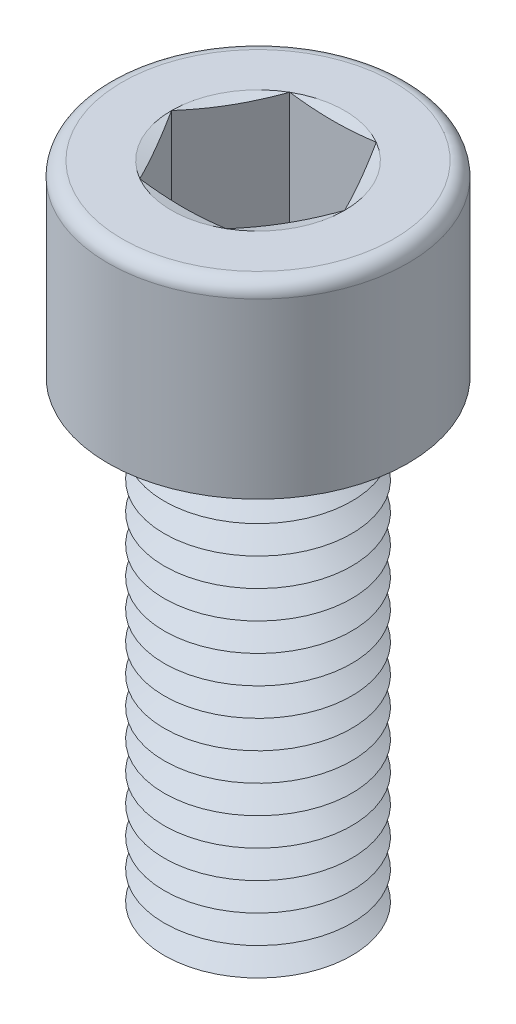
ISO-10303-21;
HEADER;
FILE_DESCRIPTION(('STEP AP214'),'2;1');
FILE_NAME('part.step','',(''),(''),'','','');
FILE_SCHEMA(('AUTOMOTIVE_DESIGN { 1 0 10303 214 1 1 1 1 }'));
ENDSEC;
DATA;
#1=APPLICATION_CONTEXT('core data for automotive mechanical design processes');
#2=APPLICATION_PROTOCOL_DEFINITION('international standard','automotive_design',2000,#1);
#3=PRODUCT_CONTEXT('',#1,'mechanical');
#4=PRODUCT('Part','Part','',(#3));
#5=PRODUCT_RELATED_PRODUCT_CATEGORY('part','',(#4));
#6=PRODUCT_DEFINITION_FORMATION('','',#4);
#7=PRODUCT_DEFINITION_CONTEXT('part definition',#1,'design');
#8=PRODUCT_DEFINITION('design','',#6,#7);
#9=PRODUCT_DEFINITION_SHAPE('','',#8);
#10=(LENGTH_UNIT() NAMED_UNIT(*) SI_UNIT(.MILLI.,.METRE.));
#11=(NAMED_UNIT(*) PLANE_ANGLE_UNIT() SI_UNIT($,.RADIAN.));
#12=(NAMED_UNIT(*) SI_UNIT($,.STERADIAN.) SOLID_ANGLE_UNIT());
#13=UNCERTAINTY_MEASURE_WITH_UNIT(LENGTH_MEASURE(1.E-05),#10,'distance_accuracy_value','');
#14=(GEOMETRIC_REPRESENTATION_CONTEXT(3) GLOBAL_UNCERTAINTY_ASSIGNED_CONTEXT((#13)) GLOBAL_UNIT_ASSIGNED_CONTEXT((#10,
#11,#12)) REPRESENTATION_CONTEXT('',''));
#15=CARTESIAN_POINT('',(0.,0.,0.));
#16=DIRECTION('',(0.,0.,1.));
#17=DIRECTION('',(1.,0.,0.));
#18=AXIS2_PLACEMENT_3D('',#15,#16,#17);
#19=CARTESIAN_POINT('',(0.,6.,0.));
#20=DIRECTION('',(0.,1.,0.));
#21=DIRECTION('',(0.,0.,1.));
#22=AXIS2_PLACEMENT_3D('',#19,#20,#21);
#23=CONICAL_SURFACE('',#22,3.70096189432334,1.0471975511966);
#24=CARTESIAN_POINT('',(0.,6.75,0.));
#25=DIRECTION('',(0.,1.,0.));
#26=DIRECTION('',(0.,0.,1.));
#27=AXIS2_PLACEMENT_3D('',#24,#25,#26);
#28=CIRCLE('',#27,5.);
#29=CARTESIAN_POINT('',(0.,6.75,5.));
#30=VERTEX_POINT('',#29);
#31=EDGE_CURVE('E446',#30,#30,#28,.T.);
#32=ORIENTED_EDGE('',*,*,#31,.F.);
#33=EDGE_LOOP('',(#32));
#34=FACE_BOUND('',#33,.T.);
#35=CARTESIAN_POINT('',(0.,6.,0.));
#36=DIRECTION('',(0.,1.,0.));
#37=DIRECTION('',(0.,0.,1.));
#38=AXIS2_PLACEMENT_3D('',#35,#36,#37);
#39=CIRCLE('',#38,3.70096189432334);
#40=CARTESIAN_POINT('',(0.,6.,3.70096189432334));
#41=VERTEX_POINT('',#40);
#42=EDGE_CURVE('E450',#41,#41,#39,.T.);
#43=ORIENTED_EDGE('',*,*,#42,.T.);
#44=EDGE_LOOP('',(#43));
#45=FACE_BOUND('',#44,.T.);
#46=ADVANCED_FACE('F41',(#34,#45),#23,.T.);
#47=CARTESIAN_POINT('',(0.,5.25,0.));
#48=DIRECTION('',(0.,-1.,0.));
#49=DIRECTION('',(0.,0.,-1.));
#50=AXIS2_PLACEMENT_3D('',#47,#48,#49);
#51=CONICAL_SURFACE('',#50,5.,1.0471975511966);
#52=ORIENTED_EDGE('',*,*,#42,.F.);
#53=EDGE_LOOP('',(#52));
#54=FACE_BOUND('',#53,.T.);
#55=CARTESIAN_POINT('',(0.,5.25,0.));
#56=DIRECTION('',(0.,1.,0.));
#57=DIRECTION('',(0.,0.,1.));
#58=AXIS2_PLACEMENT_3D('',#55,#56,#57);
#59=CIRCLE('',#58,5.);
#60=CARTESIAN_POINT('',(0.,5.25,5.));
#61=VERTEX_POINT('',#60);
#62=EDGE_CURVE('E454',#61,#61,#59,.T.);
#63=ORIENTED_EDGE('',*,*,#62,.T.);
#64=EDGE_LOOP('',(#63));
#65=FACE_BOUND('',#64,.T.);
#66=ADVANCED_FACE('F251',(#54,#65),#51,.T.);
#67=CARTESIAN_POINT('',(0.,0.,0.));
#68=DIRECTION('',(0.,1.,0.));
#69=DIRECTION('',(0.,0.,1.));
#70=AXIS2_PLACEMENT_3D('',#67,#68,#69);
#71=PLANE('',#70);
#72=CARTESIAN_POINT('',(0.,0.,0.));
#73=DIRECTION('',(0.,1.,0.));
#74=DIRECTION('',(0.,0.,1.));
#75=AXIS2_PLACEMENT_3D('',#72,#73,#74);
#76=CIRCLE('',#75,3.70096189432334);
#77=CARTESIAN_POINT('',(0.,0.,3.70096189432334));
#78=VERTEX_POINT('',#77);
#79=EDGE_CURVE('E481',#78,#78,#76,.T.);
#80=ORIENTED_EDGE('',*,*,#79,.F.);
#81=EDGE_LOOP('',(#80));
#82=FACE_BOUND('',#81,.T.);
#83=ADVANCED_FACE('F248',(#82),#71,.F.);
#84=CARTESIAN_POINT('',(0.,0.,0.));
#85=DIRECTION('',(0.,1.,0.));
#86=DIRECTION('',(0.,0.,1.));
#87=AXIS2_PLACEMENT_3D('',#84,#85,#86);
#88=CONICAL_SURFACE('',#87,3.70096189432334,1.0471975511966);
#89=CARTESIAN_POINT('',(0.,0.749999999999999,0.));
#90=DIRECTION('',(0.,1.,0.));
#91=DIRECTION('',(0.,0.,1.));
#92=AXIS2_PLACEMENT_3D('',#89,#90,#91);
#93=CIRCLE('',#92,5.);
#94=CARTESIAN_POINT('',(0.,0.749999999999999,5.));
#95=VERTEX_POINT('',#94);
#96=EDGE_CURVE('E477',#95,#95,#93,.T.);
#97=ORIENTED_EDGE('',*,*,#96,.F.);
#98=EDGE_LOOP('',(#97));
#99=FACE_BOUND('',#98,.T.);
#100=ORIENTED_EDGE('',*,*,#79,.T.);
#101=EDGE_LOOP('',(#100));
#102=FACE_BOUND('',#101,.T.);
#103=ADVANCED_FACE('F250',(#99,#102),#88,.T.);
#104=CARTESIAN_POINT('',(0.,0.749999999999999,0.));
#105=DIRECTION('',(0.,-1.,0.));
#106=DIRECTION('',(0.,0.,-1.));
#107=AXIS2_PLACEMENT_3D('',#104,#105,#106);
#108=CONICAL_SURFACE('',#107,5.,1.0471975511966);
#109=CARTESIAN_POINT('',(0.,1.5,0.));
#110=DIRECTION('',(0.,1.,0.));
#111=DIRECTION('',(0.,0.,1.));
#112=AXIS2_PLACEMENT_3D('',#109,#110,#111);
#113=CIRCLE('',#112,3.70096189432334);
#114=CARTESIAN_POINT('',(0.,1.5,3.70096189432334));
#115=VERTEX_POINT('',#114);
#116=EDGE_CURVE('E473',#115,#115,#113,.T.);
#117=ORIENTED_EDGE('',*,*,#116,.F.);
#118=EDGE_LOOP('',(#117));
#119=FACE_BOUND('',#118,.T.);
#120=ORIENTED_EDGE('',*,*,#96,.T.);
#121=EDGE_LOOP('',(#120));
#122=FACE_BOUND('',#121,.T.);
#123=ADVANCED_FACE('F291',(#119,#122),#108,.T.);
#124=CARTESIAN_POINT('',(0.,1.5,0.));
#125=DIRECTION('',(0.,1.,0.));
#126=DIRECTION('',(0.,0.,1.));
#127=AXIS2_PLACEMENT_3D('',#124,#125,#126);
#128=CONICAL_SURFACE('',#127,3.70096189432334,1.0471975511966);
#129=CARTESIAN_POINT('',(0.,2.25,0.));
#130=DIRECTION('',(0.,1.,0.));
#131=DIRECTION('',(0.,0.,1.));
#132=AXIS2_PLACEMENT_3D('',#129,#130,#131);
#133=CIRCLE('',#132,5.);
#134=CARTESIAN_POINT('',(0.,2.25,5.));
#135=VERTEX_POINT('',#134);
#136=EDGE_CURVE('E469',#135,#135,#133,.T.);
#137=ORIENTED_EDGE('',*,*,#136,.F.);
#138=EDGE_LOOP('',(#137));
#139=FACE_BOUND('',#138,.T.);
#140=ORIENTED_EDGE('',*,*,#116,.T.);
#141=EDGE_LOOP('',(#140));
#142=FACE_BOUND('',#141,.T.);
#143=ADVANCED_FACE('F286',(#139,#142),#128,.T.);
#144=CARTESIAN_POINT('',(0.,2.25,0.));
#145=DIRECTION('',(0.,-1.,0.));
#146=DIRECTION('',(0.,0.,-1.));
#147=AXIS2_PLACEMENT_3D('',#144,#145,#146);
#148=CONICAL_SURFACE('',#147,5.,1.0471975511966);
#149=CARTESIAN_POINT('',(0.,3.,0.));
#150=DIRECTION('',(0.,1.,0.));
#151=DIRECTION('',(0.,0.,1.));
#152=AXIS2_PLACEMENT_3D('',#149,#150,#151);
#153=CIRCLE('',#152,3.70096189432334);
#154=CARTESIAN_POINT('',(0.,3.,3.70096189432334));
#155=VERTEX_POINT('',#154);
#156=EDGE_CURVE('E465',#155,#155,#153,.T.);
#157=ORIENTED_EDGE('',*,*,#156,.F.);
#158=EDGE_LOOP('',(#157));
#159=FACE_BOUND('',#158,.T.);
#160=ORIENTED_EDGE('',*,*,#136,.T.);
#161=EDGE_LOOP('',(#160));
#162=FACE_BOUND('',#161,.T.);
#163=ADVANCED_FACE('F283',(#159,#162),#148,.T.);
#164=CARTESIAN_POINT('',(0.,3.,0.));
#165=DIRECTION('',(0.,1.,0.));
#166=DIRECTION('',(0.,0.,1.));
#167=AXIS2_PLACEMENT_3D('',#164,#165,#166);
#168=CONICAL_SURFACE('',#167,3.70096189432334,1.0471975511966);
#169=CARTESIAN_POINT('',(0.,3.75,0.));
#170=DIRECTION('',(0.,1.,0.));
#171=DIRECTION('',(0.,0.,1.));
#172=AXIS2_PLACEMENT_3D('',#169,#170,#171);
#173=CIRCLE('',#172,5.);
#174=CARTESIAN_POINT('',(0.,3.75,5.));
#175=VERTEX_POINT('',#174);
#176=EDGE_CURVE('E461',#175,#175,#173,.T.);
#177=ORIENTED_EDGE('',*,*,#176,.F.);
#178=EDGE_LOOP('',(#177));
#179=FACE_BOUND('',#178,.T.);
#180=ORIENTED_EDGE('',*,*,#156,.T.);
#181=EDGE_LOOP('',(#180));
#182=FACE_BOUND('',#181,.T.);
#183=ADVANCED_FACE('F277',(#179,#182),#168,.T.);
#184=CARTESIAN_POINT('',(0.,3.75,0.));
#185=DIRECTION('',(0.,-1.,0.));
#186=DIRECTION('',(0.,0.,-1.));
#187=AXIS2_PLACEMENT_3D('',#184,#185,#186);
#188=CONICAL_SURFACE('',#187,5.,1.0471975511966);
#189=CARTESIAN_POINT('',(0.,4.5,0.));
#190=DIRECTION('',(0.,1.,0.));
#191=DIRECTION('',(0.,0.,1.));
#192=AXIS2_PLACEMENT_3D('',#189,#190,#191);
#193=CIRCLE('',#192,3.70096189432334);
#194=CARTESIAN_POINT('',(0.,4.5,3.70096189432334));
#195=VERTEX_POINT('',#194);
#196=EDGE_CURVE('E458',#195,#195,#193,.T.);
#197=ORIENTED_EDGE('',*,*,#196,.F.);
#198=EDGE_LOOP('',(#197));
#199=FACE_BOUND('',#198,.T.);
#200=ORIENTED_EDGE('',*,*,#176,.T.);
#201=EDGE_LOOP('',(#200));
#202=FACE_BOUND('',#201,.T.);
#203=ADVANCED_FACE('F273',(#199,#202),#188,.T.);
#204=CARTESIAN_POINT('',(0.,4.5,0.));
#205=DIRECTION('',(0.,1.,0.));
#206=DIRECTION('',(0.,0.,1.));
#207=AXIS2_PLACEMENT_3D('',#204,#205,#206);
#208=CONICAL_SURFACE('',#207,3.70096189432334,1.0471975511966);
#209=ORIENTED_EDGE('',*,*,#62,.F.);
#210=EDGE_LOOP('',(#209));
#211=FACE_BOUND('',#210,.T.);
#212=ORIENTED_EDGE('',*,*,#196,.T.);
#213=EDGE_LOOP('',(#212));
#214=FACE_BOUND('',#213,.T.);
#215=ADVANCED_FACE('F276',(#211,#214),#208,.T.);
#216=CARTESIAN_POINT('',(0.,7.5,0.));
#217=DIRECTION('',(0.,1.,0.));
#218=DIRECTION('',(0.,0.,1.));
#219=AXIS2_PLACEMENT_3D('',#216,#217,#218);
#220=CONICAL_SURFACE('',#219,3.70096189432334,1.0471975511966);
#221=CARTESIAN_POINT('',(0.,8.25,0.));
#222=DIRECTION('',(0.,1.,0.));
#223=DIRECTION('',(0.,0.,1.));
#224=AXIS2_PLACEMENT_3D('',#221,#222,#223);
#225=CIRCLE('',#224,5.);
#226=CARTESIAN_POINT('',(0.,8.25,5.));
#227=VERTEX_POINT('',#226);
#228=EDGE_CURVE('E438',#227,#227,#225,.T.);
#229=ORIENTED_EDGE('',*,*,#228,.F.);
#230=EDGE_LOOP('',(#229));
#231=FACE_BOUND('',#230,.T.);
#232=CARTESIAN_POINT('',(0.,7.5,0.));
#233=DIRECTION('',(0.,1.,0.));
#234=DIRECTION('',(0.,0.,1.));
#235=AXIS2_PLACEMENT_3D('',#232,#233,#234);
#236=CIRCLE('',#235,3.70096189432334);
#237=CARTESIAN_POINT('',(0.,7.5,3.70096189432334));
#238=VERTEX_POINT('',#237);
#239=EDGE_CURVE('E442',#238,#238,#236,.T.);
#240=ORIENTED_EDGE('',*,*,#239,.T.);
#241=EDGE_LOOP('',(#240));
#242=FACE_BOUND('',#241,.T.);
#243=ADVANCED_FACE('F281',(#231,#242),#220,.T.);
#244=CARTESIAN_POINT('',(0.,6.75,0.));
#245=DIRECTION('',(0.,-1.,0.));
#246=DIRECTION('',(0.,0.,-1.));
#247=AXIS2_PLACEMENT_3D('',#244,#245,#246);
#248=CONICAL_SURFACE('',#247,5.,1.0471975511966);
#249=ORIENTED_EDGE('',*,*,#239,.F.);
#250=EDGE_LOOP('',(#249));
#251=FACE_BOUND('',#250,.T.);
#252=ORIENTED_EDGE('',*,*,#31,.T.);
#253=EDGE_LOOP('',(#252));
#254=FACE_BOUND('',#253,.T.);
#255=ADVANCED_FACE('F730',(#251,#254),#248,.T.);
#256=CARTESIAN_POINT('',(0.,9.,0.));
#257=DIRECTION('',(0.,1.,0.));
#258=DIRECTION('',(0.,0.,1.));
#259=AXIS2_PLACEMENT_3D('',#256,#257,#258);
#260=CONICAL_SURFACE('',#259,3.70096189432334,1.0471975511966);
#261=CARTESIAN_POINT('',(0.,9.75,0.));
#262=DIRECTION('',(0.,1.,0.));
#263=DIRECTION('',(0.,0.,1.));
#264=AXIS2_PLACEMENT_3D('',#261,#262,#263);
#265=CIRCLE('',#264,5.);
#266=CARTESIAN_POINT('',(0.,9.75,5.));
#267=VERTEX_POINT('',#266);
#268=EDGE_CURVE('E430',#267,#267,#265,.T.);
#269=ORIENTED_EDGE('',*,*,#268,.F.);
#270=EDGE_LOOP('',(#269));
#271=FACE_BOUND('',#270,.T.);
#272=CARTESIAN_POINT('',(0.,9.,0.));
#273=DIRECTION('',(0.,1.,0.));
#274=DIRECTION('',(0.,0.,1.));
#275=AXIS2_PLACEMENT_3D('',#272,#273,#274);
#276=CIRCLE('',#275,3.70096189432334);
#277=CARTESIAN_POINT('',(0.,9.,3.70096189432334));
#278=VERTEX_POINT('',#277);
#279=EDGE_CURVE('E434',#278,#278,#276,.T.);
#280=ORIENTED_EDGE('',*,*,#279,.T.);
#281=EDGE_LOOP('',(#280));
#282=FACE_BOUND('',#281,.T.);
#283=ADVANCED_FACE('F739',(#271,#282),#260,.T.);
#284=CARTESIAN_POINT('',(0.,8.25,0.));
#285=DIRECTION('',(0.,-1.,0.));
#286=DIRECTION('',(0.,0.,-1.));
#287=AXIS2_PLACEMENT_3D('',#284,#285,#286);
#288=CONICAL_SURFACE('',#287,5.,1.0471975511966);
#289=ORIENTED_EDGE('',*,*,#279,.F.);
#290=EDGE_LOOP('',(#289));
#291=FACE_BOUND('',#290,.T.);
#292=ORIENTED_EDGE('',*,*,#228,.T.);
#293=EDGE_LOOP('',(#292));
#294=FACE_BOUND('',#293,.T.);
#295=ADVANCED_FACE('F749',(#291,#294),#288,.T.);
#296=CARTESIAN_POINT('',(0.,10.5,0.));
#297=DIRECTION('',(0.,1.,0.));
#298=DIRECTION('',(0.,0.,1.));
#299=AXIS2_PLACEMENT_3D('',#296,#297,#298);
#300=CONICAL_SURFACE('',#299,3.70096189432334,1.0471975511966);
#301=CARTESIAN_POINT('',(0.,11.25,0.));
#302=DIRECTION('',(0.,1.,0.));
#303=DIRECTION('',(0.,0.,1.));
#304=AXIS2_PLACEMENT_3D('',#301,#302,#303);
#305=CIRCLE('',#304,5.);
#306=CARTESIAN_POINT('',(0.,11.25,5.));
#307=VERTEX_POINT('',#306);
#308=EDGE_CURVE('E422',#307,#307,#305,.T.);
#309=ORIENTED_EDGE('',*,*,#308,.F.);
#310=EDGE_LOOP('',(#309));
#311=FACE_BOUND('',#310,.T.);
#312=CARTESIAN_POINT('',(0.,10.5,0.));
#313=DIRECTION('',(0.,1.,0.));
#314=DIRECTION('',(0.,0.,1.));
#315=AXIS2_PLACEMENT_3D('',#312,#313,#314);
#316=CIRCLE('',#315,3.70096189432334);
#317=CARTESIAN_POINT('',(0.,10.5,3.70096189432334));
#318=VERTEX_POINT('',#317);
#319=EDGE_CURVE('E426',#318,#318,#316,.T.);
#320=ORIENTED_EDGE('',*,*,#319,.T.);
#321=EDGE_LOOP('',(#320));
#322=FACE_BOUND('',#321,.T.);
#323=ADVANCED_FACE('F759',(#311,#322),#300,.T.);
#324=CARTESIAN_POINT('',(0.,9.75,0.));
#325=DIRECTION('',(0.,-1.,0.));
#326=DIRECTION('',(0.,0.,-1.));
#327=AXIS2_PLACEMENT_3D('',#324,#325,#326);
#328=CONICAL_SURFACE('',#327,5.,1.0471975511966);
#329=ORIENTED_EDGE('',*,*,#319,.F.);
#330=EDGE_LOOP('',(#329));
#331=FACE_BOUND('',#330,.T.);
#332=ORIENTED_EDGE('',*,*,#268,.T.);
#333=EDGE_LOOP('',(#332));
#334=FACE_BOUND('',#333,.T.);
#335=ADVANCED_FACE('F769',(#331,#334),#328,.T.);
#336=CARTESIAN_POINT('',(0.,12.,0.));
#337=DIRECTION('',(0.,1.,0.));
#338=DIRECTION('',(0.,0.,1.));
#339=AXIS2_PLACEMENT_3D('',#336,#337,#338);
#340=CONICAL_SURFACE('',#339,3.70096189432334,1.0471975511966);
#341=CARTESIAN_POINT('',(0.,12.75,0.));
#342=DIRECTION('',(0.,1.,0.));
#343=DIRECTION('',(0.,0.,1.));
#344=AXIS2_PLACEMENT_3D('',#341,#342,#343);
#345=CIRCLE('',#344,5.);
#346=CARTESIAN_POINT('',(0.,12.75,5.));
#347=VERTEX_POINT('',#346);
#348=EDGE_CURVE('E414',#347,#347,#345,.T.);
#349=ORIENTED_EDGE('',*,*,#348,.F.);
#350=EDGE_LOOP('',(#349));
#351=FACE_BOUND('',#350,.T.);
#352=CARTESIAN_POINT('',(0.,12.,0.));
#353=DIRECTION('',(0.,1.,0.));
#354=DIRECTION('',(0.,0.,1.));
#355=AXIS2_PLACEMENT_3D('',#352,#353,#354);
#356=CIRCLE('',#355,3.70096189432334);
#357=CARTESIAN_POINT('',(0.,12.,3.70096189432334));
#358=VERTEX_POINT('',#357);
#359=EDGE_CURVE('E418',#358,#358,#356,.T.);
#360=ORIENTED_EDGE('',*,*,#359,.T.);
#361=EDGE_LOOP('',(#360));
#362=FACE_BOUND('',#361,.T.);
#363=ADVANCED_FACE('F779',(#351,#362),#340,.T.);
#364=CARTESIAN_POINT('',(0.,11.25,0.));
#365=DIRECTION('',(0.,-1.,0.));
#366=DIRECTION('',(0.,0.,-1.));
#367=AXIS2_PLACEMENT_3D('',#364,#365,#366);
#368=CONICAL_SURFACE('',#367,5.,1.0471975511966);
#369=ORIENTED_EDGE('',*,*,#359,.F.);
#370=EDGE_LOOP('',(#369));
#371=FACE_BOUND('',#370,.T.);
#372=ORIENTED_EDGE('',*,*,#308,.T.);
#373=EDGE_LOOP('',(#372));
#374=FACE_BOUND('',#373,.T.);
#375=ADVANCED_FACE('F789',(#371,#374),#368,.T.);
#376=CARTESIAN_POINT('',(0.,13.5,0.));
#377=DIRECTION('',(0.,1.,0.));
#378=DIRECTION('',(0.,0.,1.));
#379=AXIS2_PLACEMENT_3D('',#376,#377,#378);
#380=CONICAL_SURFACE('',#379,3.70096189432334,1.0471975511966);
#381=CARTESIAN_POINT('',(0.,14.25,0.));
#382=DIRECTION('',(0.,1.,0.));
#383=DIRECTION('',(0.,0.,1.));
#384=AXIS2_PLACEMENT_3D('',#381,#382,#383);
#385=CIRCLE('',#384,5.);
#386=CARTESIAN_POINT('',(0.,14.25,5.));
#387=VERTEX_POINT('',#386);
#388=EDGE_CURVE('E406',#387,#387,#385,.T.);
#389=ORIENTED_EDGE('',*,*,#388,.F.);
#390=EDGE_LOOP('',(#389));
#391=FACE_BOUND('',#390,.T.);
#392=CARTESIAN_POINT('',(0.,13.5,0.));
#393=DIRECTION('',(0.,1.,0.));
#394=DIRECTION('',(0.,0.,1.));
#395=AXIS2_PLACEMENT_3D('',#392,#393,#394);
#396=CIRCLE('',#395,3.70096189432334);
#397=CARTESIAN_POINT('',(0.,13.5,3.70096189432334));
#398=VERTEX_POINT('',#397);
#399=EDGE_CURVE('E410',#398,#398,#396,.T.);
#400=ORIENTED_EDGE('',*,*,#399,.T.);
#401=EDGE_LOOP('',(#400));
#402=FACE_BOUND('',#401,.T.);
#403=ADVANCED_FACE('F799',(#391,#402),#380,.T.);
#404=CARTESIAN_POINT('',(0.,12.75,0.));
#405=DIRECTION('',(0.,-1.,0.));
#406=DIRECTION('',(0.,0.,-1.));
#407=AXIS2_PLACEMENT_3D('',#404,#405,#406);
#408=CONICAL_SURFACE('',#407,5.,1.0471975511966);
#409=ORIENTED_EDGE('',*,*,#399,.F.);
#410=EDGE_LOOP('',(#409));
#411=FACE_BOUND('',#410,.T.);
#412=ORIENTED_EDGE('',*,*,#348,.T.);
#413=EDGE_LOOP('',(#412));
#414=FACE_BOUND('',#413,.T.);
#415=ADVANCED_FACE('F809',(#411,#414),#408,.T.);
#416=CARTESIAN_POINT('',(0.,15.,0.));
#417=DIRECTION('',(0.,1.,0.));
#418=DIRECTION('',(0.,0.,1.));
#419=AXIS2_PLACEMENT_3D('',#416,#417,#418);
#420=CONICAL_SURFACE('',#419,3.70096189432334,1.0471975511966);
#421=CARTESIAN_POINT('',(0.,15.75,0.));
#422=DIRECTION('',(0.,1.,0.));
#423=DIRECTION('',(0.,0.,1.));
#424=AXIS2_PLACEMENT_3D('',#421,#422,#423);
#425=CIRCLE('',#424,5.);
#426=CARTESIAN_POINT('',(0.,15.75,5.));
#427=VERTEX_POINT('',#426);
#428=EDGE_CURVE('E398',#427,#427,#425,.T.);
#429=ORIENTED_EDGE('',*,*,#428,.F.);
#430=EDGE_LOOP('',(#429));
#431=FACE_BOUND('',#430,.T.);
#432=CARTESIAN_POINT('',(0.,15.,0.));
#433=DIRECTION('',(0.,1.,0.));
#434=DIRECTION('',(0.,0.,1.));
#435=AXIS2_PLACEMENT_3D('',#432,#433,#434);
#436=CIRCLE('',#435,3.70096189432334);
#437=CARTESIAN_POINT('',(0.,15.,3.70096189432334));
#438=VERTEX_POINT('',#437);
#439=EDGE_CURVE('E402',#438,#438,#436,.T.);
#440=ORIENTED_EDGE('',*,*,#439,.T.);
#441=EDGE_LOOP('',(#440));
#442=FACE_BOUND('',#441,.T.);
#443=ADVANCED_FACE('F819',(#431,#442),#420,.T.);
#444=CARTESIAN_POINT('',(0.,14.25,0.));
#445=DIRECTION('',(0.,-1.,0.));
#446=DIRECTION('',(0.,0.,-1.));
#447=AXIS2_PLACEMENT_3D('',#444,#445,#446);
#448=CONICAL_SURFACE('',#447,5.,1.0471975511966);
#449=ORIENTED_EDGE('',*,*,#439,.F.);
#450=EDGE_LOOP('',(#449));
#451=FACE_BOUND('',#450,.T.);
#452=ORIENTED_EDGE('',*,*,#388,.T.);
#453=EDGE_LOOP('',(#452));
#454=FACE_BOUND('',#453,.T.);
#455=ADVANCED_FACE('F829',(#451,#454),#448,.T.);
#456=CARTESIAN_POINT('',(0.,16.5,0.));
#457=DIRECTION('',(0.,1.,0.));
#458=DIRECTION('',(0.,0.,1.));
#459=AXIS2_PLACEMENT_3D('',#456,#457,#458);
#460=CONICAL_SURFACE('',#459,3.70096189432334,1.0471975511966);
#461=CARTESIAN_POINT('',(0.,17.25,0.));
#462=DIRECTION('',(0.,1.,0.));
#463=DIRECTION('',(0.,0.,1.));
#464=AXIS2_PLACEMENT_3D('',#461,#462,#463);
#465=CIRCLE('',#464,5.);
#466=CARTESIAN_POINT('',(0.,17.25,5.));
#467=VERTEX_POINT('',#466);
#468=EDGE_CURVE('E390',#467,#467,#465,.T.);
#469=ORIENTED_EDGE('',*,*,#468,.F.);
#470=EDGE_LOOP('',(#469));
#471=FACE_BOUND('',#470,.T.);
#472=CARTESIAN_POINT('',(0.,16.5,0.));
#473=DIRECTION('',(0.,1.,0.));
#474=DIRECTION('',(0.,0.,1.));
#475=AXIS2_PLACEMENT_3D('',#472,#473,#474);
#476=CIRCLE('',#475,3.70096189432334);
#477=CARTESIAN_POINT('',(0.,16.5,3.70096189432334));
#478=VERTEX_POINT('',#477);
#479=EDGE_CURVE('E394',#478,#478,#476,.T.);
#480=ORIENTED_EDGE('',*,*,#479,.T.);
#481=EDGE_LOOP('',(#480));
#482=FACE_BOUND('',#481,.T.);
#483=ADVANCED_FACE('F839',(#471,#482),#460,.T.);
#484=CARTESIAN_POINT('',(0.,15.75,0.));
#485=DIRECTION('',(0.,-1.,0.));
#486=DIRECTION('',(0.,0.,-1.));
#487=AXIS2_PLACEMENT_3D('',#484,#485,#486);
#488=CONICAL_SURFACE('',#487,5.,1.0471975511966);
#489=ORIENTED_EDGE('',*,*,#479,.F.);
#490=EDGE_LOOP('',(#489));
#491=FACE_BOUND('',#490,.T.);
#492=ORIENTED_EDGE('',*,*,#428,.T.);
#493=EDGE_LOOP('',(#492));
#494=FACE_BOUND('',#493,.T.);
#495=ADVANCED_FACE('F849',(#491,#494),#488,.T.);
#496=CARTESIAN_POINT('',(0.,18.,0.));
#497=DIRECTION('',(0.,1.,0.));
#498=DIRECTION('',(0.,0.,1.));
#499=AXIS2_PLACEMENT_3D('',#496,#497,#498);
#500=CONICAL_SURFACE('',#499,3.70096189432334,1.0471975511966);
#501=CARTESIAN_POINT('',(0.,18.75,0.));
#502=DIRECTION('',(0.,1.,0.));
#503=DIRECTION('',(0.,0.,1.));
#504=AXIS2_PLACEMENT_3D('',#501,#502,#503);
#505=CIRCLE('',#504,5.);
#506=CARTESIAN_POINT('',(0.,18.75,5.));
#507=VERTEX_POINT('',#506);
#508=EDGE_CURVE('E382',#507,#507,#505,.T.);
#509=ORIENTED_EDGE('',*,*,#508,.F.);
#510=EDGE_LOOP('',(#509));
#511=FACE_BOUND('',#510,.T.);
#512=CARTESIAN_POINT('',(0.,18.,0.));
#513=DIRECTION('',(0.,1.,0.));
#514=DIRECTION('',(0.,0.,1.));
#515=AXIS2_PLACEMENT_3D('',#512,#513,#514);
#516=CIRCLE('',#515,3.70096189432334);
#517=CARTESIAN_POINT('',(0.,18.,3.70096189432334));
#518=VERTEX_POINT('',#517);
#519=EDGE_CURVE('E386',#518,#518,#516,.T.);
#520=ORIENTED_EDGE('',*,*,#519,.T.);
#521=EDGE_LOOP('',(#520));
#522=FACE_BOUND('',#521,.T.);
#523=ADVANCED_FACE('F859',(#511,#522),#500,.T.);
#524=CARTESIAN_POINT('',(0.,17.25,0.));
#525=DIRECTION('',(0.,-1.,0.));
#526=DIRECTION('',(0.,0.,-1.));
#527=AXIS2_PLACEMENT_3D('',#524,#525,#526);
#528=CONICAL_SURFACE('',#527,5.,1.0471975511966);
#529=ORIENTED_EDGE('',*,*,#519,.F.);
#530=EDGE_LOOP('',(#529));
#531=FACE_BOUND('',#530,.T.);
#532=ORIENTED_EDGE('',*,*,#468,.T.);
#533=EDGE_LOOP('',(#532));
#534=FACE_BOUND('',#533,.T.);
#535=ADVANCED_FACE('F869',(#531,#534),#528,.T.);
#536=CARTESIAN_POINT('',(0.,19.5,0.));
#537=DIRECTION('',(0.,1.,0.));
#538=DIRECTION('',(0.,0.,1.));
#539=AXIS2_PLACEMENT_3D('',#536,#537,#538);
#540=CONICAL_SURFACE('',#539,3.70096189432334,1.0471975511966);
#541=CARTESIAN_POINT('',(0.,20.25,0.));
#542=DIRECTION('',(0.,1.,0.));
#543=DIRECTION('',(0.,0.,1.));
#544=AXIS2_PLACEMENT_3D('',#541,#542,#543);
#545=CIRCLE('',#544,5.);
#546=CARTESIAN_POINT('',(0.,20.25,5.));
#547=VERTEX_POINT('',#546);
#548=EDGE_CURVE('E375',#547,#547,#545,.T.);
#549=ORIENTED_EDGE('',*,*,#548,.F.);
#550=EDGE_LOOP('',(#549));
#551=FACE_BOUND('',#550,.T.);
#552=CARTESIAN_POINT('',(0.,19.5,0.));
#553=DIRECTION('',(0.,1.,0.));
#554=DIRECTION('',(0.,0.,1.));
#555=AXIS2_PLACEMENT_3D('',#552,#553,#554);
#556=CIRCLE('',#555,3.70096189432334);
#557=CARTESIAN_POINT('',(0.,19.5,3.70096189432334));
#558=VERTEX_POINT('',#557);
#559=EDGE_CURVE('E378',#558,#558,#556,.T.);
#560=ORIENTED_EDGE('',*,*,#559,.T.);
#561=EDGE_LOOP('',(#560));
#562=FACE_BOUND('',#561,.T.);
#563=ADVANCED_FACE('F879',(#551,#562),#540,.T.);
#564=CARTESIAN_POINT('',(0.,18.75,0.));
#565=DIRECTION('',(0.,-1.,0.));
#566=DIRECTION('',(0.,0.,-1.));
#567=AXIS2_PLACEMENT_3D('',#564,#565,#566);
#568=CONICAL_SURFACE('',#567,5.,1.0471975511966);
#569=ORIENTED_EDGE('',*,*,#559,.F.);
#570=EDGE_LOOP('',(#569));
#571=FACE_BOUND('',#570,.T.);
#572=ORIENTED_EDGE('',*,*,#508,.T.);
#573=EDGE_LOOP('',(#572));
#574=FACE_BOUND('',#573,.T.);
#575=ADVANCED_FACE('F889',(#571,#574),#568,.T.);
#576=CARTESIAN_POINT('',(0.,21.,0.));
#577=DIRECTION('',(0.,1.,0.));
#578=DIRECTION('',(0.,0.,1.));
#579=AXIS2_PLACEMENT_3D('',#576,#577,#578);
#580=CONICAL_SURFACE('',#579,3.70096189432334,1.0471975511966);
#581=CARTESIAN_POINT('',(0.,21.75,0.));
#582=DIRECTION('',(0.,1.,0.));
#583=DIRECTION('',(0.,0.,1.));
#584=AXIS2_PLACEMENT_3D('',#581,#582,#583);
#585=CIRCLE('',#584,5.);
#586=CARTESIAN_POINT('',(0.,21.75,5.));
#587=VERTEX_POINT('',#586);
#588=EDGE_CURVE('E367',#587,#587,#585,.T.);
#589=ORIENTED_EDGE('',*,*,#588,.F.);
#590=EDGE_LOOP('',(#589));
#591=FACE_BOUND('',#590,.T.);
#592=CARTESIAN_POINT('',(0.,21.,0.));
#593=DIRECTION('',(0.,1.,0.));
#594=DIRECTION('',(0.,0.,1.));
#595=AXIS2_PLACEMENT_3D('',#592,#593,#594);
#596=CIRCLE('',#595,3.70096189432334);
#597=CARTESIAN_POINT('',(0.,21.,3.70096189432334));
#598=VERTEX_POINT('',#597);
#599=EDGE_CURVE('E371',#598,#598,#596,.T.);
#600=ORIENTED_EDGE('',*,*,#599,.T.);
#601=EDGE_LOOP('',(#600));
#602=FACE_BOUND('',#601,.T.);
#603=ADVANCED_FACE('F899',(#591,#602),#580,.T.);
#604=CARTESIAN_POINT('',(0.,20.25,0.));
#605=DIRECTION('',(0.,-1.,0.));
#606=DIRECTION('',(0.,0.,-1.));
#607=AXIS2_PLACEMENT_3D('',#604,#605,#606);
#608=CONICAL_SURFACE('',#607,5.,1.0471975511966);
#609=ORIENTED_EDGE('',*,*,#599,.F.);
#610=EDGE_LOOP('',(#609));
#611=FACE_BOUND('',#610,.T.);
#612=ORIENTED_EDGE('',*,*,#548,.T.);
#613=EDGE_LOOP('',(#612));
#614=FACE_BOUND('',#613,.T.);
#615=ADVANCED_FACE('F909',(#611,#614),#608,.T.);
#616=CARTESIAN_POINT('',(0.,22.5,0.));
#617=DIRECTION('',(0.,1.,0.));
#618=DIRECTION('',(0.,0.,1.));
#619=AXIS2_PLACEMENT_3D('',#616,#617,#618);
#620=CONICAL_SURFACE('',#619,3.70096189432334,1.0471975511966);
#621=CARTESIAN_POINT('',(0.,23.25,0.));
#622=DIRECTION('',(0.,1.,0.));
#623=DIRECTION('',(0.,0.,1.));
#624=AXIS2_PLACEMENT_3D('',#621,#622,#623);
#625=CIRCLE('',#624,5.);
#626=CARTESIAN_POINT('',(0.,23.25,5.));
#627=VERTEX_POINT('',#626);
#628=EDGE_CURVE('E351',#627,#627,#625,.T.);
#629=ORIENTED_EDGE('',*,*,#628,.F.);
#630=EDGE_LOOP('',(#629));
#631=FACE_BOUND('',#630,.T.);
#632=CARTESIAN_POINT('',(0.,22.5,0.));
#633=DIRECTION('',(0.,1.,0.));
#634=DIRECTION('',(0.,0.,1.));
#635=AXIS2_PLACEMENT_3D('',#632,#633,#634);
#636=CIRCLE('',#635,3.70096189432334);
#637=CARTESIAN_POINT('',(0.,22.5,3.70096189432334));
#638=VERTEX_POINT('',#637);
#639=EDGE_CURVE('E363',#638,#638,#636,.T.);
#640=ORIENTED_EDGE('',*,*,#639,.T.);
#641=EDGE_LOOP('',(#640));
#642=FACE_BOUND('',#641,.T.);
#643=ADVANCED_FACE('F919',(#631,#642),#620,.T.);
#644=CARTESIAN_POINT('',(0.,21.75,0.));
#645=DIRECTION('',(0.,-1.,0.));
#646=DIRECTION('',(0.,0.,-1.));
#647=AXIS2_PLACEMENT_3D('',#644,#645,#646);
#648=CONICAL_SURFACE('',#647,5.,1.0471975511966);
#649=ORIENTED_EDGE('',*,*,#639,.F.);
#650=EDGE_LOOP('',(#649));
#651=FACE_BOUND('',#650,.T.);
#652=ORIENTED_EDGE('',*,*,#588,.T.);
#653=EDGE_LOOP('',(#652));
#654=FACE_BOUND('',#653,.T.);
#655=ADVANCED_FACE('F929',(#651,#654),#648,.T.);
#656=CARTESIAN_POINT('',(0.,24.,0.));
#657=DIRECTION('',(0.,1.,0.));
#658=DIRECTION('',(0.,0.,1.));
#659=AXIS2_PLACEMENT_3D('',#656,#657,#658);
#660=CONICAL_SURFACE('',#659,3.70096189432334,1.0471975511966);
#661=CARTESIAN_POINT('',(0.,24.75,0.));
#662=DIRECTION('',(0.,1.,0.));
#663=DIRECTION('',(0.,0.,1.));
#664=AXIS2_PLACEMENT_3D('',#661,#662,#663);
#665=CIRCLE('',#664,5.);
#666=CARTESIAN_POINT('',(0.,24.75,5.));
#667=VERTEX_POINT('',#666);
#668=EDGE_CURVE('E358',#667,#667,#665,.T.);
#669=ORIENTED_EDGE('',*,*,#668,.F.);
#670=EDGE_LOOP('',(#669));
#671=FACE_BOUND('',#670,.T.);
#672=CARTESIAN_POINT('',(0.,24.,0.));
#673=DIRECTION('',(0.,1.,0.));
#674=DIRECTION('',(0.,0.,1.));
#675=AXIS2_PLACEMENT_3D('',#672,#673,#674);
#676=CIRCLE('',#675,3.70096189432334);
#677=CARTESIAN_POINT('',(0.,24.,3.70096189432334));
#678=VERTEX_POINT('',#677);
#679=EDGE_CURVE('E348',#678,#678,#676,.T.);
#680=ORIENTED_EDGE('',*,*,#679,.T.);
#681=EDGE_LOOP('',(#680));
#682=FACE_BOUND('',#681,.T.);
#683=ADVANCED_FACE('F939',(#671,#682),#660,.T.);
#684=CARTESIAN_POINT('',(0.,23.25,0.));
#685=DIRECTION('',(0.,-1.,0.));
#686=DIRECTION('',(0.,0.,-1.));
#687=AXIS2_PLACEMENT_3D('',#684,#685,#686);
#688=CONICAL_SURFACE('',#687,5.,1.0471975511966);
#689=ORIENTED_EDGE('',*,*,#679,.F.);
#690=EDGE_LOOP('',(#689));
#691=FACE_BOUND('',#690,.T.);
#692=ORIENTED_EDGE('',*,*,#628,.T.);
#693=EDGE_LOOP('',(#692));
#694=FACE_BOUND('',#693,.T.);
#695=ADVANCED_FACE('F195',(#691,#694),#688,.T.);
#696=CARTESIAN_POINT('',(0.,35.,0.));
#697=DIRECTION('',(0.,1.,0.));
#698=DIRECTION('',(0.,0.,1.));
#699=AXIS2_PLACEMENT_3D('',#696,#697,#698);
#700=PLANE('',#699);
#701=CARTESIAN_POINT('',(0.,35.,0.));
#702=DIRECTION('',(0.,1.,0.));
#703=DIRECTION('',(0.,0.,1.));
#704=AXIS2_PLACEMENT_3D('',#701,#702,#703);
#705=CIRCLE('',#704,4.61880215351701);
#706=CARTESIAN_POINT('',(2.3094010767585,35.,4.));
#707=VERTEX_POINT('',#706);
#708=CARTESIAN_POINT('',(4.61880215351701,35.,0.));
#709=VERTEX_POINT('',#708);
#710=EDGE_CURVE('E121',#707,#709,#705,.T.);
#711=ORIENTED_EDGE('',*,*,#710,.F.);
#712=CARTESIAN_POINT('',(0.,35.,0.));
#713=DIRECTION('',(0.,1.,0.));
#714=DIRECTION('',(0.,0.,1.));
#715=AXIS2_PLACEMENT_3D('',#712,#713,#714);
#716=CIRCLE('',#715,4.61880215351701);
#717=CARTESIAN_POINT('',(-2.3094010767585,35.,4.));
#718=VERTEX_POINT('',#717);
#719=EDGE_CURVE('E45',#718,#707,#716,.T.);
#720=ORIENTED_EDGE('',*,*,#719,.F.);
#721=CARTESIAN_POINT('',(-4.61880215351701,35.,0.));
#722=VERTEX_POINT('',#721);
#723=EDGE_CURVE('E138',#722,#718,#716,.T.);
#724=ORIENTED_EDGE('',*,*,#723,.F.);
#725=CARTESIAN_POINT('',(-2.3094010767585,35.,-4.));
#726=VERTEX_POINT('',#725);
#727=EDGE_CURVE('E553',#726,#722,#716,.T.);
#728=ORIENTED_EDGE('',*,*,#727,.F.);
#729=CARTESIAN_POINT('',(2.3094010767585,35.,-4.));
#730=VERTEX_POINT('',#729);
#731=EDGE_CURVE('E51',#730,#726,#716,.T.);
#732=ORIENTED_EDGE('',*,*,#731,.F.);
#733=EDGE_CURVE('E11',#709,#730,#716,.T.);
#734=ORIENTED_EDGE('',*,*,#733,.F.);
#735=EDGE_LOOP('',(#711,#720,#724,#728,#732,#734));
#736=FACE_BOUND('',#735,.T.);
#737=CARTESIAN_POINT('',(0.,35.,0.));
#738=DIRECTION('',(0.,1.,0.));
#739=DIRECTION('',(0.,0.,1.));
#740=AXIS2_PLACEMENT_3D('',#737,#738,#739);
#741=CIRCLE('',#740,7.25);
#742=CARTESIAN_POINT('',(0.,35.,7.25));
#743=VERTEX_POINT('',#742);
#744=EDGE_CURVE('E526',#743,#743,#741,.T.);
#745=ORIENTED_EDGE('',*,*,#744,.T.);
#746=EDGE_LOOP('',(#745));
#747=FACE_BOUND('',#746,.T.);
#748=ADVANCED_FACE('F140',(#736,#747),#700,.T.);
#749=CARTESIAN_POINT('',(0.,34.25,0.));
#750=DIRECTION('',(0.,1.,0.));
#751=DIRECTION('',(0.,0.,1.));
#752=AXIS2_PLACEMENT_3D('',#749,#750,#751);
#753=TOROIDAL_SURFACE('',#752,7.25,0.75);
#754=CARTESIAN_POINT('',(0.,34.25,0.));
#755=DIRECTION('',(0.,1.,0.));
#756=DIRECTION('',(0.,0.,1.));
#757=AXIS2_PLACEMENT_3D('',#754,#755,#756);
#758=CIRCLE('',#757,8.);
#759=CARTESIAN_POINT('',(0.,34.25,8.));
#760=VERTEX_POINT('',#759);
#761=EDGE_CURVE('E530',#760,#760,#758,.F.);
#762=ORIENTED_EDGE('',*,*,#761,.F.);
#763=EDGE_LOOP('',(#762));
#764=FACE_BOUND('',#763,.T.);
#765=ORIENTED_EDGE('',*,*,#744,.F.);
#766=EDGE_LOOP('',(#765));
#767=FACE_BOUND('',#766,.T.);
#768=ADVANCED_FACE('F43',(#764,#767),#753,.T.);
#769=CARTESIAN_POINT('',(0.,35.,0.));
#770=DIRECTION('',(0.,-1.,0.));
#771=DIRECTION('',(0.,0.,-1.));
#772=AXIS2_PLACEMENT_3D('',#769,#770,#771);
#773=CYLINDRICAL_SURFACE('',#772,8.);
#774=ORIENTED_EDGE('',*,*,#761,.T.);
#775=EDGE_LOOP('',(#774));
#776=FACE_BOUND('',#775,.T.);
#777=CARTESIAN_POINT('',(0.,25.,0.));
#778=DIRECTION('',(0.,1.,0.));
#779=DIRECTION('',(0.,0.,1.));
#780=AXIS2_PLACEMENT_3D('',#777,#778,#779);
#781=CIRCLE('',#780,8.);
#782=CARTESIAN_POINT('',(0.,25.,8.));
#783=VERTEX_POINT('',#782);
#784=EDGE_CURVE('E513',#783,#783,#781,.T.);
#785=ORIENTED_EDGE('',*,*,#784,.T.);
#786=EDGE_LOOP('',(#785));
#787=FACE_BOUND('',#786,.T.);
#788=ADVANCED_FACE('F243',(#776,#787),#773,.T.);
#789=CARTESIAN_POINT('',(0.,25.,0.));
#790=DIRECTION('',(0.,1.,0.));
#791=DIRECTION('',(0.,0.,1.));
#792=AXIS2_PLACEMENT_3D('',#789,#790,#791);
#793=PLANE('',#792);
#794=ORIENTED_EDGE('',*,*,#784,.F.);
#795=EDGE_LOOP('',(#794));
#796=FACE_BOUND('',#795,.T.);
#797=CARTESIAN_POINT('',(0.,25.,0.));
#798=DIRECTION('',(0.,1.,0.));
#799=DIRECTION('',(0.,0.,1.));
#800=AXIS2_PLACEMENT_3D('',#797,#798,#799);
#801=CIRCLE('',#800,5.);
#802=CARTESIAN_POINT('',(0.,25.,5.));
#803=VERTEX_POINT('',#802);
#804=EDGE_CURVE('E522',#803,#803,#801,.T.);
#805=ORIENTED_EDGE('',*,*,#804,.T.);
#806=EDGE_LOOP('',(#805));
#807=FACE_BOUND('',#806,.T.);
#808=ADVANCED_FACE('F239',(#796,#807),#793,.F.);
#809=CARTESIAN_POINT('',(0.,25.,0.));
#810=DIRECTION('',(0.,-1.,0.));
#811=DIRECTION('',(0.,0.,-1.));
#812=AXIS2_PLACEMENT_3D('',#809,#810,#811);
#813=CYLINDRICAL_SURFACE('',#812,5.);
#814=ORIENTED_EDGE('',*,*,#668,.T.);
#815=EDGE_LOOP('',(#814));
#816=FACE_BOUND('',#815,.T.);
#817=ORIENTED_EDGE('',*,*,#804,.F.);
#818=EDGE_LOOP('',(#817));
#819=FACE_BOUND('',#818,.T.);
#820=ADVANCED_FACE('F242',(#816,#819),#813,.T.);
#821=CARTESIAN_POINT('',(0.,35.,0.));
#822=DIRECTION('',(0.,1.,0.));
#823=DIRECTION('',(0.,0.,1.));
#824=AXIS2_PLACEMENT_3D('',#821,#822,#823);
#825=CONICAL_SURFACE('',#824,4.61880215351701,1.30899693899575);
#826=ORIENTED_EDGE('',*,*,#719,.T.);
#827=CARTESIAN_POINT('',(-6.02881516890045,35.7010337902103,4.));
#828=CARTESIAN_POINT('',(-5.84819587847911,35.6607170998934,4.));
#829=CARTESIAN_POINT('',(-5.6674614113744,35.6209072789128,4.));
#830=CARTESIAN_POINT('',(-5.30570552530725,35.5425748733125,4.));
#831=CARTESIAN_POINT('',(-5.12468409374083,35.5040523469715,4.));
#832=CARTESIAN_POINT('',(-4.76212658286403,35.4285326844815,4.));
#833=CARTESIAN_POINT('',(-4.58059016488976,35.3915371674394,4.));
#834=CARTESIAN_POINT('',(-4.21713405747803,35.3194839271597,4.));
#835=CARTESIAN_POINT('',(-4.03521437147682,35.2844261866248,4.));
#836=CARTESIAN_POINT('',(-3.67250657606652,35.217001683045,4.));
#837=CARTESIAN_POINT('',(-3.4917223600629,35.1846141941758,4.));
#838=CARTESIAN_POINT('',(-3.12965653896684,35.1227577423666,4.));
#839=CARTESIAN_POINT('',(-2.94837492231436,35.093288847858,4.));
#840=CARTESIAN_POINT('',(-2.40374454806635,35.0102645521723,4.));
#841=CARTESIAN_POINT('',(-2.03952090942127,34.9620742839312,4.));
#842=CARTESIAN_POINT('',(-1.48950033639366,34.9051820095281,4.));
#843=CARTESIAN_POINT('',(-1.30450135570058,34.8887355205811,4.));
#844=CARTESIAN_POINT('',(-0.934053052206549,34.861988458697,4.));
#845=CARTESIAN_POINT('',(-0.748603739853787,34.8516877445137,4.));
#846=CARTESIAN_POINT('',(-0.377528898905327,34.8378309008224,4.));
#847=CARTESIAN_POINT('',(-0.191903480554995,34.834271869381,4.));
#848=CARTESIAN_POINT('',(0.179350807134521,34.8341156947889,4.));
#849=CARTESIAN_POINT('',(0.364979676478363,34.8375185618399,4.));
#850=CARTESIAN_POINT('',(0.736742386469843,34.8510980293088,4.));
#851=CARTESIAN_POINT('',(0.922875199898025,34.8613021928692,4.));
#852=CARTESIAN_POINT('',(1.29469888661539,34.8879135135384,4.));
#853=CARTESIAN_POINT('',(1.48038973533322,34.9043210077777,4.));
#854=CARTESIAN_POINT('',(1.85132520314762,34.942529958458,4.));
#855=CARTESIAN_POINT('',(2.03656946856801,34.9643347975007,4.));
#856=CARTESIAN_POINT('',(2.40646407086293,35.0124559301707,4.));
#857=CARTESIAN_POINT('',(2.59111440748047,35.0387722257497,4.));
#858=CARTESIAN_POINT('',(2.9646704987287,35.0958323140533,4.));
#859=CARTESIAN_POINT('',(3.15356118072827,35.1266739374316,4.));
#860=CARTESIAN_POINT('',(3.53080577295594,35.1914895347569,4.));
#861=CARTESIAN_POINT('',(3.71915966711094,35.225463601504,4.));
#862=CARTESIAN_POINT('',(4.28356279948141,35.3311227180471,4.));
#863=CARTESIAN_POINT('',(4.65891157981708,35.4065379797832,4.));
#864=CARTESIAN_POINT('',(5.4083535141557,35.5637698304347,4.));
#865=CARTESIAN_POINT('',(5.7824462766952,35.645588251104,4.));
#866=CARTESIAN_POINT('',(6.52968076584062,35.8134827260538,4.));
#867=CARTESIAN_POINT('',(6.90282246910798,35.8995588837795,4.));
#868=CARTESIAN_POINT('',(7.64386653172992,36.0735615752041,4.));
#869=CARTESIAN_POINT('',(8.0117772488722,36.1614526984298,4.));
#870=CARTESIAN_POINT('',(8.7471149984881,36.3392675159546,4.));
#871=CARTESIAN_POINT('',(9.11454201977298,36.4291912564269,4.));
#872=CARTESIAN_POINT('',(9.84851788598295,36.6103931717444,4.));
#873=CARTESIAN_POINT('',(10.2150672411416,36.7016692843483,4.));
#874=CARTESIAN_POINT('',(10.9478692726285,36.8853497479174,4.));
#875=CARTESIAN_POINT('',(11.3141219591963,36.977754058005,4.));
#876=CARTESIAN_POINT('',(11.6802738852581,37.0705515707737,4.));
#877=B_SPLINE_CURVE_WITH_KNOTS('',3,(#827,#828,#829,#830,#831,#832,#833,#834,#835,#836,#837,
#838,#839,#840,#841,#842,#843,#844,#845,#846,#847,#848,#849,#850,#851,#852,#853,#854,#855,#856,
#857,#858,#859,#860,#861,#862,#863,#864,#865,#866,#867,#868,#869,#870,#871,#872,#873,#874,#875,
#876),.UNSPECIFIED.,.F.,.F.,(4,2,2,2,2,2,2,2,2,2,2,2,2,2,2,2,2,2,2,2,2,2,2,2,4),(0.,
0.555194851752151,1.11041480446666,1.6662090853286,2.22199840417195,2.77296094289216,
3.32393639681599,4.42561440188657,4.98271716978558,5.53980713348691,6.09665724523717,
6.65350817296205,7.21262964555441,7.77178150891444,8.33128469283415,8.89078811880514,
9.46493123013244,10.0390913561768,11.1875388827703,12.3363161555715,13.4851213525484,
14.6199040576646,15.7547125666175,16.8879395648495,18.0211256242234),.UNSPECIFIED.);
#878=EDGE_CURVE('E127',#718,#707,#877,.T.);
#879=ORIENTED_EDGE('',*,*,#878,.F.);
#880=EDGE_LOOP('',(#826,#879));
#881=FACE_BOUND('',#880,.T.);
#882=ADVANCED_FACE('F132',(#881),#825,.F.);
#883=ORIENTED_EDGE('',*,*,#723,.T.);
#884=CARTESIAN_POINT('',(-4.61891762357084,35.0000309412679,-0.000199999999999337));
#885=CARTESIAN_POINT('',(-4.52300443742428,34.9743194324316,0.165926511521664));
#886=CARTESIAN_POINT('',(-4.42691734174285,34.9509775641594,0.332354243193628));
#887=CARTESIAN_POINT('',(-4.23440378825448,34.9099680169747,0.665797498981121));
#888=CARTESIAN_POINT('',(-4.13797720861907,34.8923026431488,0.832813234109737));
#889=CARTESIAN_POINT('',(-3.94536936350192,34.8636774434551,1.16641980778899));
#890=CARTESIAN_POINT('',(-3.84918940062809,34.8526834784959,1.33300839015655));
#891=CARTESIAN_POINT('',(-3.65670681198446,34.8379416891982,1.66639801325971));
#892=CARTESIAN_POINT('',(-3.5604042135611,34.8341924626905,1.83319900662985));
#893=CARTESIAN_POINT('',(-3.3677990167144,34.8341924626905,2.16680099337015));
#894=CARTESIAN_POINT('',(-3.27149641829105,34.8379416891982,2.33360198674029));
#895=CARTESIAN_POINT('',(-3.07901382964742,34.8526834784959,2.66699160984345));
#896=CARTESIAN_POINT('',(-2.98283386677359,34.8636774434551,2.83358019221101));
#897=CARTESIAN_POINT('',(-2.79022602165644,34.8923026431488,3.16718676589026));
#898=CARTESIAN_POINT('',(-2.69379944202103,34.9099680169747,3.33420250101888));
#899=CARTESIAN_POINT('',(-2.50128588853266,34.9509775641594,3.66764575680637));
#900=CARTESIAN_POINT('',(-2.40519879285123,34.9743194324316,3.83407348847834));
#901=CARTESIAN_POINT('',(-2.30928560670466,35.0000309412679,4.0002));
#902=B_SPLINE_CURVE_WITH_KNOTS('',3,(#884,#885,#886,#887,#888,#889,#890,#891,#892,#893,#894,
#895,#896,#897,#898,#899,#900,#901),.UNSPECIFIED.,.F.,.F.,(4,2,2,2,2,2,2,2,4),(0.,
0.580655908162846,1.1615473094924,1.73944052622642,2.31722188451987,2.89500324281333,
3.47289645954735,4.0537878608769,4.63444376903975),.UNSPECIFIED.);
#903=EDGE_CURVE('E163',#722,#718,#902,.T.);
#904=ORIENTED_EDGE('',*,*,#903,.F.);
#905=EDGE_LOOP('',(#883,#904));
#906=FACE_BOUND('',#905,.T.);
#907=ADVANCED_FACE('F258',(#906),#825,.F.);
#908=ORIENTED_EDGE('',*,*,#727,.T.);
#909=CARTESIAN_POINT('',(-2.30928560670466,35.0000309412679,-4.0002));
#910=CARTESIAN_POINT('',(-2.40519879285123,34.9743194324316,-3.83407348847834));
#911=CARTESIAN_POINT('',(-2.50128588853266,34.9509775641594,-3.66764575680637));
#912=CARTESIAN_POINT('',(-2.69379944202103,34.9099680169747,-3.33420250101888));
#913=CARTESIAN_POINT('',(-2.79022602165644,34.8923026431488,-3.16718676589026));
#914=CARTESIAN_POINT('',(-2.98283386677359,34.8636774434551,-2.83358019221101));
#915=CARTESIAN_POINT('',(-3.07901382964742,34.8526834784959,-2.66699160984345));
#916=CARTESIAN_POINT('',(-3.27149641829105,34.8379416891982,-2.33360198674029));
#917=CARTESIAN_POINT('',(-3.3677990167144,34.8341924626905,-2.16680099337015));
#918=CARTESIAN_POINT('',(-3.5604042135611,34.8341924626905,-1.83319900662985));
#919=CARTESIAN_POINT('',(-3.65670681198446,34.8379416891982,-1.66639801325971));
#920=CARTESIAN_POINT('',(-3.84918940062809,34.8526834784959,-1.33300839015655));
#921=CARTESIAN_POINT('',(-3.94536936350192,34.8636774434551,-1.16641980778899));
#922=CARTESIAN_POINT('',(-4.13797720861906,34.8923026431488,-0.832813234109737));
#923=CARTESIAN_POINT('',(-4.23440378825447,34.9099680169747,-0.665797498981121));
#924=CARTESIAN_POINT('',(-4.42691734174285,34.9509775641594,-0.332354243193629));
#925=CARTESIAN_POINT('',(-4.52300443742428,34.9743194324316,-0.165926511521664));
#926=CARTESIAN_POINT('',(-4.61891762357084,35.0000309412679,0.000199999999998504));
#927=B_SPLINE_CURVE_WITH_KNOTS('',3,(#909,#910,#911,#912,#913,#914,#915,#916,#917,#918,#919,
#920,#921,#922,#923,#924,#925,#926),.UNSPECIFIED.,.F.,.F.,(4,2,2,2,2,2,2,2,4),(0.,
0.580655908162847,1.1615473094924,1.73944052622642,2.31722188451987,2.89500324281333,
3.47289645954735,4.0537878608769,4.63444376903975),.UNSPECIFIED.);
#928=EDGE_CURVE('E63',#726,#722,#927,.T.);
#929=ORIENTED_EDGE('',*,*,#928,.F.);
#930=EDGE_LOOP('',(#908,#929));
#931=FACE_BOUND('',#930,.T.);
#932=ADVANCED_FACE('F193',(#931),#825,.F.);
#933=ORIENTED_EDGE('',*,*,#731,.T.);
#934=CARTESIAN_POINT('',(-6.02881516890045,35.7010337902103,-4.));
#935=CARTESIAN_POINT('',(-5.84819587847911,35.6607170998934,-4.));
#936=CARTESIAN_POINT('',(-5.6674614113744,35.6209072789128,-4.));
#937=CARTESIAN_POINT('',(-5.30570552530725,35.5425748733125,-4.));
#938=CARTESIAN_POINT('',(-5.12468409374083,35.5040523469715,-4.));
#939=CARTESIAN_POINT('',(-4.76212658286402,35.4285326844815,-4.));
#940=CARTESIAN_POINT('',(-4.58059016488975,35.3915371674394,-4.));
#941=CARTESIAN_POINT('',(-4.21713405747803,35.3194839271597,-4.));
#942=CARTESIAN_POINT('',(-4.03521437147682,35.2844261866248,-4.));
#943=CARTESIAN_POINT('',(-3.67250657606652,35.217001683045,-4.));
#944=CARTESIAN_POINT('',(-3.4917223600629,35.1846141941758,-4.));
#945=CARTESIAN_POINT('',(-3.12965653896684,35.1227577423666,-4.));
#946=CARTESIAN_POINT('',(-2.94837492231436,35.093288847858,-4.));
#947=CARTESIAN_POINT('',(-2.40374454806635,35.0102645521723,-4.));
#948=CARTESIAN_POINT('',(-2.03952090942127,34.9620742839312,-4.));
#949=CARTESIAN_POINT('',(-1.48950033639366,34.9051820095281,-4.));
#950=CARTESIAN_POINT('',(-1.30450135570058,34.8887355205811,-4.));
#951=CARTESIAN_POINT('',(-0.934053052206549,34.861988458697,-4.));
#952=CARTESIAN_POINT('',(-0.748603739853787,34.8516877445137,-4.));
#953=CARTESIAN_POINT('',(-0.377528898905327,34.8378309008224,-4.));
#954=CARTESIAN_POINT('',(-0.191903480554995,34.834271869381,-4.));
#955=CARTESIAN_POINT('',(0.179350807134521,34.8341156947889,-4.));
#956=CARTESIAN_POINT('',(0.364979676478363,34.8375185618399,-4.));
#957=CARTESIAN_POINT('',(0.736742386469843,34.8510980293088,-4.));
#958=CARTESIAN_POINT('',(0.922875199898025,34.8613021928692,-4.));
#959=CARTESIAN_POINT('',(1.29469888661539,34.8879135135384,-4.));
#960=CARTESIAN_POINT('',(1.48038973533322,34.9043210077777,-4.));
#961=CARTESIAN_POINT('',(1.85132520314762,34.942529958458,-4.));
#962=CARTESIAN_POINT('',(2.03656946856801,34.9643347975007,-4.));
#963=CARTESIAN_POINT('',(2.40646407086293,35.0124559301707,-4.));
#964=CARTESIAN_POINT('',(2.59111440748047,35.0387722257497,-4.));
#965=CARTESIAN_POINT('',(2.9646704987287,35.0958323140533,-4.));
#966=CARTESIAN_POINT('',(3.15356118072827,35.1266739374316,-4.));
#967=CARTESIAN_POINT('',(3.53080577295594,35.1914895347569,-4.));
#968=CARTESIAN_POINT('',(3.71915966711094,35.225463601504,-4.));
#969=CARTESIAN_POINT('',(4.28356279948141,35.3311227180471,-4.));
#970=CARTESIAN_POINT('',(4.65891157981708,35.4065379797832,-4.));
#971=CARTESIAN_POINT('',(5.4083535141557,35.5637698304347,-4.));
#972=CARTESIAN_POINT('',(5.7824462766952,35.645588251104,-4.));
#973=CARTESIAN_POINT('',(6.52968076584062,35.8134827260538,-4.));
#974=CARTESIAN_POINT('',(6.90282246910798,35.8995588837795,-4.));
#975=CARTESIAN_POINT('',(7.64386653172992,36.0735615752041,-4.));
#976=CARTESIAN_POINT('',(8.0117772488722,36.1614526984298,-4.));
#977=CARTESIAN_POINT('',(8.7471149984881,36.3392675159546,-4.));
#978=CARTESIAN_POINT('',(9.11454201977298,36.4291912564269,-4.));
#979=CARTESIAN_POINT('',(9.84851788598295,36.6103931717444,-4.));
#980=CARTESIAN_POINT('',(10.2150672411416,36.7016692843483,-4.));
#981=CARTESIAN_POINT('',(10.9478692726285,36.8853497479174,-4.));
#982=CARTESIAN_POINT('',(11.3141219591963,36.977754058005,-4.));
#983=CARTESIAN_POINT('',(11.6802738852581,37.0705515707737,-4.));
#984=B_SPLINE_CURVE_WITH_KNOTS('',3,(#934,#935,#936,#937,#938,#939,#940,#941,#942,#943,#944,
#945,#946,#947,#948,#949,#950,#951,#952,#953,#954,#955,#956,#957,#958,#959,#960,#961,#962,#963,
#964,#965,#966,#967,#968,#969,#970,#971,#972,#973,#974,#975,#976,#977,#978,#979,#980,#981,#982,
#983),.UNSPECIFIED.,.F.,.F.,(4,2,2,2,2,2,2,2,2,2,2,2,2,2,2,2,2,2,2,2,2,2,2,2,4),(0.,
0.555194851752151,1.11041480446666,1.6662090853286,2.22199840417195,2.77296094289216,
3.32393639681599,4.42561440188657,4.98271716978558,5.53980713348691,6.09665724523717,
6.65350817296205,7.21262964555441,7.77178150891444,8.33128469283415,8.89078811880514,
9.46493123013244,10.0390913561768,11.1875388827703,12.3363161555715,13.4851213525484,
14.6199040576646,15.7547125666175,16.8879395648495,18.0211256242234),.UNSPECIFIED.);
#985=EDGE_CURVE('E214',#730,#726,#984,.F.);
#986=ORIENTED_EDGE('',*,*,#985,.F.);
#987=EDGE_LOOP('',(#933,#986));
#988=FACE_BOUND('',#987,.T.);
#989=ADVANCED_FACE('F188',(#988),#825,.F.);
#990=ORIENTED_EDGE('',*,*,#733,.T.);
#991=CARTESIAN_POINT('',(4.61891762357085,35.0000309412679,0.000199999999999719));
#992=CARTESIAN_POINT('',(4.52300443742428,34.9743194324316,-0.165926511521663));
#993=CARTESIAN_POINT('',(4.42691734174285,34.9509775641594,-0.332354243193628));
#994=CARTESIAN_POINT('',(4.23440378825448,34.9099680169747,-0.665797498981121));
#995=CARTESIAN_POINT('',(4.13797720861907,34.8923026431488,-0.832813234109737));
#996=CARTESIAN_POINT('',(3.94536936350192,34.8636774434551,-1.16641980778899));
#997=CARTESIAN_POINT('',(3.84918940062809,34.8526834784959,-1.33300839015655));
#998=CARTESIAN_POINT('',(3.65670681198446,34.8379416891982,-1.66639801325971));
#999=CARTESIAN_POINT('',(3.56040421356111,34.8341924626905,-1.83319900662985));
#1000=CARTESIAN_POINT('',(3.3677990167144,34.8341924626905,-2.16680099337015));
#1001=CARTESIAN_POINT('',(3.27149641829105,34.8379416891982,-2.33360198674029));
#1002=CARTESIAN_POINT('',(3.07901382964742,34.8526834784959,-2.66699160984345));
#1003=CARTESIAN_POINT('',(2.98283386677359,34.8636774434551,-2.83358019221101));
#1004=CARTESIAN_POINT('',(2.79022602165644,34.8923026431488,-3.16718676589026));
#1005=CARTESIAN_POINT('',(2.69379944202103,34.9099680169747,-3.33420250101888));
#1006=CARTESIAN_POINT('',(2.50128588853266,34.9509775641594,-3.66764575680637));
#1007=CARTESIAN_POINT('',(2.40519879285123,34.9743194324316,-3.83407348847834));
#1008=CARTESIAN_POINT('',(2.30928560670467,35.0000309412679,-4.0002));
#1009=B_SPLINE_CURVE_WITH_KNOTS('',3,(#991,#992,#993,#994,#995,#996,#997,#998,#999,#1000,#1001,
#1002,#1003,#1004,#1005,#1006,#1007,#1008),.UNSPECIFIED.,.F.,.F.,(4,2,2,2,2,2,2,2,4),(0.,
0.580655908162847,1.1615473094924,1.73944052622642,2.31722188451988,2.89500324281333,
3.47289645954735,4.0537878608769,4.63444376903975),.UNSPECIFIED.);
#1010=EDGE_CURVE('E56',#709,#730,#1009,.T.);
#1011=ORIENTED_EDGE('',*,*,#1010,.F.);
#1012=EDGE_LOOP('',(#990,#1011));
#1013=FACE_BOUND('',#1012,.T.);
#1014=ADVANCED_FACE('F192',(#1013),#825,.F.);
#1015=ORIENTED_EDGE('',*,*,#710,.T.);
#1016=CARTESIAN_POINT('',(2.30928560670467,35.0000309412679,4.0002));
#1017=CARTESIAN_POINT('',(2.40519879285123,34.9743194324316,3.83407348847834));
#1018=CARTESIAN_POINT('',(2.50128588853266,34.9509775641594,3.66764575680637));
#1019=CARTESIAN_POINT('',(2.69379944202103,34.9099680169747,3.33420250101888));
#1020=CARTESIAN_POINT('',(2.79022602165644,34.8923026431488,3.16718676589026));
#1021=CARTESIAN_POINT('',(2.98283386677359,34.8636774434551,2.83358019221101));
#1022=CARTESIAN_POINT('',(3.07901382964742,34.8526834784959,2.66699160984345));
#1023=CARTESIAN_POINT('',(3.27149641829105,34.8379416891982,2.33360198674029));
#1024=CARTESIAN_POINT('',(3.36779901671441,34.8341924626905,2.16680099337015));
#1025=CARTESIAN_POINT('',(3.56040421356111,34.8341924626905,1.83319900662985));
#1026=CARTESIAN_POINT('',(3.65670681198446,34.8379416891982,1.66639801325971));
#1027=CARTESIAN_POINT('',(3.84918940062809,34.8526834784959,1.33300839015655));
#1028=CARTESIAN_POINT('',(3.94536936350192,34.8636774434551,1.16641980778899));
#1029=CARTESIAN_POINT('',(4.13797720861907,34.8923026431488,0.832813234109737));
#1030=CARTESIAN_POINT('',(4.23440378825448,34.9099680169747,0.66579749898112));
#1031=CARTESIAN_POINT('',(4.42691734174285,34.9509775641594,0.332354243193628));
#1032=CARTESIAN_POINT('',(4.52300443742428,34.9743194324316,0.165926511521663));
#1033=CARTESIAN_POINT('',(4.61891762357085,35.0000309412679,-0.000200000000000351));
#1034=B_SPLINE_CURVE_WITH_KNOTS('',3,(#1016,#1017,#1018,#1019,#1020,#1021,#1022,#1023,#1024,
#1025,#1026,#1027,#1028,#1029,#1030,#1031,#1032,#1033),.UNSPECIFIED.,.F.,.F.,(4,2,2,2,2,2,2,2,
4),(0.,0.580655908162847,1.1615473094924,1.73944052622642,2.31722188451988,2.89500324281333,
3.47289645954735,4.0537878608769,4.63444376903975),.UNSPECIFIED.);
#1035=EDGE_CURVE('E117',#707,#709,#1034,.T.);
#1036=ORIENTED_EDGE('',*,*,#1035,.F.);
#1037=EDGE_LOOP('',(#1015,#1036));
#1038=FACE_BOUND('',#1037,.T.);
#1039=ADVANCED_FACE('F119',(#1038),#825,.F.);
#1040=CARTESIAN_POINT('',(0.,27.,0.));
#1041=DIRECTION('',(0.,1.,0.));
#1042=DIRECTION('',(0.,0.,1.));
#1043=AXIS2_PLACEMENT_3D('',#1040,#1041,#1042);
#1044=CONICAL_SURFACE('',#1043,4.,1.0471975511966);
#1045=CARTESIAN_POINT('',(0.,24.6905989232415,0.));
#1046=VERTEX_POINT('',#1045);
#1047=VERTEX_LOOP('',#1046);
#1048=FACE_BOUND('',#1047,.T.);
#1049=CARTESIAN_POINT('',(0.,27.,0.));
#1050=DIRECTION('',(0.,1.,0.));
#1051=DIRECTION('',(0.,0.,1.));
#1052=AXIS2_PLACEMENT_3D('',#1049,#1050,#1051);
#1053=CIRCLE('',#1052,4.);
#1054=CARTESIAN_POINT('',(0.,27.,4.));
#1055=VERTEX_POINT('',#1054);
#1056=CARTESIAN_POINT('',(3.46410161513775,27.,2.));
#1057=VERTEX_POINT('',#1056);
#1058=EDGE_CURVE('E485',#1055,#1057,#1053,.T.);
#1059=ORIENTED_EDGE('',*,*,#1058,.T.);
#1060=CARTESIAN_POINT('',(0.,27.,0.));
#1061=DIRECTION('',(0.,1.,0.));
#1062=DIRECTION('',(0.,0.,1.));
#1063=AXIS2_PLACEMENT_3D('',#1060,#1061,#1062);
#1064=CIRCLE('',#1063,4.);
#1065=CARTESIAN_POINT('',(3.46410161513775,27.,-2.));
#1066=VERTEX_POINT('',#1065);
#1067=EDGE_CURVE('E139',#1057,#1066,#1064,.T.);
#1068=ORIENTED_EDGE('',*,*,#1067,.T.);
#1069=CARTESIAN_POINT('',(0.,27.,-4.));
#1070=VERTEX_POINT('',#1069);
#1071=EDGE_CURVE('E541',#1066,#1070,#1064,.T.);
#1072=ORIENTED_EDGE('',*,*,#1071,.T.);
#1073=CARTESIAN_POINT('',(-3.46410161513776,27.,-2.));
#1074=VERTEX_POINT('',#1073);
#1075=EDGE_CURVE('E539',#1070,#1074,#1064,.T.);
#1076=ORIENTED_EDGE('',*,*,#1075,.T.);
#1077=CARTESIAN_POINT('',(-3.46410161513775,27.,2.));
#1078=VERTEX_POINT('',#1077);
#1079=EDGE_CURVE('E535',#1074,#1078,#1064,.T.);
#1080=ORIENTED_EDGE('',*,*,#1079,.T.);
#1081=EDGE_CURVE('E533',#1078,#1055,#1064,.T.);
#1082=ORIENTED_EDGE('',*,*,#1081,.T.);
#1083=EDGE_LOOP('',(#1059,#1068,#1072,#1076,#1080,#1082));
#1084=FACE_BOUND('',#1083,.T.);
#1085=ADVANCED_FACE('F301',(#1048,#1084),#1044,.F.);
#1086=CARTESIAN_POINT('',(2.3094010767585,27.,-4.));
#1087=DIRECTION('',(0.,1.,0.));
#1088=DIRECTION('',(0.,0.,1.));
#1089=AXIS2_PLACEMENT_3D('',#1086,#1087,#1088);
#1090=PLANE('',#1089);
#1091=ORIENTED_EDGE('',*,*,#1075,.F.);
#1092=DIRECTION('',(-1.,0.,0.));
#1093=VECTOR('',#1092,1.);
#1094=CARTESIAN_POINT('',(2.3094010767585,27.,-4.));
#1095=LINE('',#1094,#1093);
#1096=CARTESIAN_POINT('',(-2.3094010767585,27.,-4.));
#1097=VERTEX_POINT('',#1096);
#1098=EDGE_CURVE('E493',#1070,#1097,#1095,.T.);
#1099=ORIENTED_EDGE('',*,*,#1098,.T.);
#1100=DIRECTION('',(-0.5,0.,0.866025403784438));
#1101=VECTOR('',#1100,1.);
#1102=CARTESIAN_POINT('',(-2.3094010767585,27.,-4.));
#1103=LINE('',#1102,#1101);
#1104=EDGE_CURVE('E338',#1097,#1074,#1103,.T.);
#1105=ORIENTED_EDGE('',*,*,#1104,.T.);
#1106=EDGE_LOOP('',(#1091,#1099,#1105));
#1107=FACE_BOUND('',#1106,.T.);
#1108=ADVANCED_FACE('F304',(#1107),#1090,.T.);
#1109=ORIENTED_EDGE('',*,*,#1079,.F.);
#1110=CARTESIAN_POINT('',(-4.618802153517,27.,0.));
#1111=VERTEX_POINT('',#1110);
#1112=EDGE_CURVE('E498',#1074,#1111,#1103,.T.);
#1113=ORIENTED_EDGE('',*,*,#1112,.T.);
#1114=DIRECTION('',(0.5,0.,0.866025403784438));
#1115=VECTOR('',#1114,1.);
#1116=CARTESIAN_POINT('',(-4.618802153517,27.,0.));
#1117=LINE('',#1116,#1115);
#1118=EDGE_CURVE('E328',#1111,#1078,#1117,.T.);
#1119=ORIENTED_EDGE('',*,*,#1118,.T.);
#1120=EDGE_LOOP('',(#1109,#1113,#1119));
#1121=FACE_BOUND('',#1120,.T.);
#1122=ADVANCED_FACE('F309',(#1121),#1090,.T.);
#1123=ORIENTED_EDGE('',*,*,#1081,.F.);
#1124=CARTESIAN_POINT('',(-2.3094010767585,27.,4.));
#1125=VERTEX_POINT('',#1124);
#1126=EDGE_CURVE('E501',#1078,#1125,#1117,.T.);
#1127=ORIENTED_EDGE('',*,*,#1126,.T.);
#1128=DIRECTION('',(1.,0.,0.));
#1129=VECTOR('',#1128,1.);
#1130=CARTESIAN_POINT('',(-2.3094010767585,27.,4.));
#1131=LINE('',#1130,#1129);
#1132=EDGE_CURVE('E505',#1125,#1055,#1131,.T.);
#1133=ORIENTED_EDGE('',*,*,#1132,.T.);
#1134=EDGE_LOOP('',(#1123,#1127,#1133));
#1135=FACE_BOUND('',#1134,.T.);
#1136=ADVANCED_FACE('F306',(#1135),#1090,.T.);
#1137=ORIENTED_EDGE('',*,*,#1058,.F.);
#1138=CARTESIAN_POINT('',(2.3094010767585,27.,4.));
#1139=VERTEX_POINT('',#1138);
#1140=EDGE_CURVE('E504',#1055,#1139,#1131,.T.);
#1141=ORIENTED_EDGE('',*,*,#1140,.T.);
#1142=DIRECTION('',(0.5,0.,-0.866025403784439));
#1143=VECTOR('',#1142,1.);
#1144=CARTESIAN_POINT('',(2.3094010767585,27.,4.));
#1145=LINE('',#1144,#1143);
#1146=EDGE_CURVE('E151',#1139,#1057,#1145,.T.);
#1147=ORIENTED_EDGE('',*,*,#1146,.T.);
#1148=EDGE_LOOP('',(#1137,#1141,#1147));
#1149=FACE_BOUND('',#1148,.T.);
#1150=ADVANCED_FACE('F308',(#1149),#1090,.T.);
#1151=ORIENTED_EDGE('',*,*,#1067,.F.);
#1152=CARTESIAN_POINT('',(4.61880215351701,27.,0.));
#1153=VERTEX_POINT('',#1152);
#1154=EDGE_CURVE('E509',#1057,#1153,#1145,.T.);
#1155=ORIENTED_EDGE('',*,*,#1154,.T.);
#1156=DIRECTION('',(-0.5,0.,-0.866025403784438));
#1157=VECTOR('',#1156,1.);
#1158=CARTESIAN_POINT('',(4.61880215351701,27.,0.));
#1159=LINE('',#1158,#1157);
#1160=EDGE_CURVE('E489',#1153,#1066,#1159,.T.);
#1161=ORIENTED_EDGE('',*,*,#1160,.T.);
#1162=EDGE_LOOP('',(#1151,#1155,#1161));
#1163=FACE_BOUND('',#1162,.T.);
#1164=ADVANCED_FACE('F593',(#1163),#1090,.T.);
#1165=ORIENTED_EDGE('',*,*,#1071,.F.);
#1166=CARTESIAN_POINT('',(2.3094010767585,27.,-4.));
#1167=VERTEX_POINT('',#1166);
#1168=EDGE_CURVE('E488',#1066,#1167,#1159,.T.);
#1169=ORIENTED_EDGE('',*,*,#1168,.T.);
#1170=EDGE_CURVE('E494',#1167,#1070,#1095,.T.);
#1171=ORIENTED_EDGE('',*,*,#1170,.T.);
#1172=EDGE_LOOP('',(#1165,#1169,#1171));
#1173=FACE_BOUND('',#1172,.T.);
#1174=ADVANCED_FACE('F235',(#1173),#1090,.T.);
#1175=CARTESIAN_POINT('',(4.61880215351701,27.,0.));
#1176=DIRECTION('',(0.866025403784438,0.,-0.5));
#1177=DIRECTION('',(-0.5,0.,-0.866025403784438));
#1178=AXIS2_PLACEMENT_3D('',#1175,#1176,#1177);
#1179=PLANE('',#1178);
#1180=DIRECTION('',(0.,1.,0.));
#1181=VECTOR('',#1180,1.);
#1182=CARTESIAN_POINT('',(4.61880215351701,27.,0.));
#1183=LINE('',#1182,#1181);
#1184=EDGE_CURVE('E155',#1153,#709,#1183,.T.);
#1185=ORIENTED_EDGE('',*,*,#1184,.T.);
#1186=ORIENTED_EDGE('',*,*,#1010,.T.);
#1187=DIRECTION('',(0.,1.,0.));
#1188=VECTOR('',#1187,1.);
#1189=CARTESIAN_POINT('',(2.3094010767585,27.,-4.));
#1190=LINE('',#1189,#1188);
#1191=EDGE_CURVE('E341',#1167,#730,#1190,.T.);
#1192=ORIENTED_EDGE('',*,*,#1191,.F.);
#1193=ORIENTED_EDGE('',*,*,#1168,.F.);
#1194=ORIENTED_EDGE('',*,*,#1160,.F.);
#1195=EDGE_LOOP('',(#1185,#1186,#1192,#1193,#1194));
#1196=FACE_BOUND('',#1195,.T.);
#1197=ADVANCED_FACE('F231',(#1196),#1179,.F.);
#1198=CARTESIAN_POINT('',(2.3094010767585,27.,4.));
#1199=DIRECTION('',(0.866025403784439,0.,0.5));
#1200=DIRECTION('',(0.5,0.,-0.866025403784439));
#1201=AXIS2_PLACEMENT_3D('',#1198,#1199,#1200);
#1202=PLANE('',#1201);
#1203=DIRECTION('',(0.,1.,0.));
#1204=VECTOR('',#1203,1.);
#1205=CARTESIAN_POINT('',(2.3094010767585,27.,4.));
#1206=LINE('',#1205,#1204);
#1207=EDGE_CURVE('E147',#1139,#707,#1206,.T.);
#1208=ORIENTED_EDGE('',*,*,#1207,.T.);
#1209=ORIENTED_EDGE('',*,*,#1035,.T.);
#1210=ORIENTED_EDGE('',*,*,#1184,.F.);
#1211=ORIENTED_EDGE('',*,*,#1154,.F.);
#1212=ORIENTED_EDGE('',*,*,#1146,.F.);
#1213=EDGE_LOOP('',(#1208,#1209,#1210,#1211,#1212));
#1214=FACE_BOUND('',#1213,.T.);
#1215=ADVANCED_FACE('F148',(#1214),#1202,.F.);
#1216=CARTESIAN_POINT('',(-2.3094010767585,27.,4.));
#1217=DIRECTION('',(0.,0.,1.));
#1218=DIRECTION('',(1.,0.,0.));
#1219=AXIS2_PLACEMENT_3D('',#1216,#1217,#1218);
#1220=PLANE('',#1219);
#1221=DIRECTION('',(0.,1.,0.));
#1222=VECTOR('',#1221,1.);
#1223=CARTESIAN_POINT('',(-2.3094010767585,27.,4.));
#1224=LINE('',#1223,#1222);
#1225=EDGE_CURVE('E156',#1125,#718,#1224,.T.);
#1226=ORIENTED_EDGE('',*,*,#1225,.T.);
#1227=ORIENTED_EDGE('',*,*,#878,.T.);
#1228=ORIENTED_EDGE('',*,*,#1207,.F.);
#1229=ORIENTED_EDGE('',*,*,#1140,.F.);
#1230=ORIENTED_EDGE('',*,*,#1132,.F.);
#1231=EDGE_LOOP('',(#1226,#1227,#1228,#1229,#1230));
#1232=FACE_BOUND('',#1231,.T.);
#1233=ADVANCED_FACE('F158',(#1232),#1220,.F.);
#1234=CARTESIAN_POINT('',(-4.618802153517,27.,0.));
#1235=DIRECTION('',(-0.866025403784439,0.,0.5));
#1236=DIRECTION('',(0.5,0.,0.866025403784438));
#1237=AXIS2_PLACEMENT_3D('',#1234,#1235,#1236);
#1238=PLANE('',#1237);
#1239=DIRECTION('',(0.,1.,0.));
#1240=VECTOR('',#1239,1.);
#1241=CARTESIAN_POINT('',(-4.618802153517,27.,0.));
#1242=LINE('',#1241,#1240);
#1243=EDGE_CURVE('E325',#1111,#722,#1242,.T.);
#1244=ORIENTED_EDGE('',*,*,#1243,.T.);
#1245=ORIENTED_EDGE('',*,*,#903,.T.);
#1246=ORIENTED_EDGE('',*,*,#1225,.F.);
#1247=ORIENTED_EDGE('',*,*,#1126,.F.);
#1248=ORIENTED_EDGE('',*,*,#1118,.F.);
#1249=EDGE_LOOP('',(#1244,#1245,#1246,#1247,#1248));
#1250=FACE_BOUND('',#1249,.T.);
#1251=ADVANCED_FACE('F225',(#1250),#1238,.F.);
#1252=CARTESIAN_POINT('',(-2.3094010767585,27.,-4.));
#1253=DIRECTION('',(-0.866025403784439,0.,-0.5));
#1254=DIRECTION('',(-0.5,0.,0.866025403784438));
#1255=AXIS2_PLACEMENT_3D('',#1252,#1253,#1254);
#1256=PLANE('',#1255);
#1257=DIRECTION('',(0.,1.,0.));
#1258=VECTOR('',#1257,1.);
#1259=CARTESIAN_POINT('',(-2.3094010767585,27.,-4.));
#1260=LINE('',#1259,#1258);
#1261=EDGE_CURVE('E331',#1097,#726,#1260,.T.);
#1262=ORIENTED_EDGE('',*,*,#1261,.T.);
#1263=ORIENTED_EDGE('',*,*,#928,.T.);
#1264=ORIENTED_EDGE('',*,*,#1243,.F.);
#1265=ORIENTED_EDGE('',*,*,#1112,.F.);
#1266=ORIENTED_EDGE('',*,*,#1104,.F.);
#1267=EDGE_LOOP('',(#1262,#1263,#1264,#1265,#1266));
#1268=FACE_BOUND('',#1267,.T.);
#1269=ADVANCED_FACE('F221',(#1268),#1256,.F.);
#1270=CARTESIAN_POINT('',(2.3094010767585,27.,-4.));
#1271=DIRECTION('',(0.,0.,-1.));
#1272=DIRECTION('',(-1.,0.,0.));
#1273=AXIS2_PLACEMENT_3D('',#1270,#1271,#1272);
#1274=PLANE('',#1273);
#1275=ORIENTED_EDGE('',*,*,#1191,.T.);
#1276=ORIENTED_EDGE('',*,*,#985,.T.);
#1277=ORIENTED_EDGE('',*,*,#1261,.F.);
#1278=ORIENTED_EDGE('',*,*,#1098,.F.);
#1279=ORIENTED_EDGE('',*,*,#1170,.F.);
#1280=EDGE_LOOP('',(#1275,#1276,#1277,#1278,#1279));
#1281=FACE_BOUND('',#1280,.T.);
#1282=ADVANCED_FACE('F224',(#1281),#1274,.F.);
#1283=CLOSED_SHELL('',(#46,#66,#83,#103,#123,#143,#163,#183,#203,#215,#243,#255,#283,#295,#323,
#335,#363,#375,#403,#415,#443,#455,#483,#495,#523,#535,#563,#575,#603,#615,#643,#655,#683,#695,
#748,#768,#788,#808,#820,#882,#907,#932,#989,#1014,#1039,#1085,#1108,#1122,#1136,#1150,#1164,
#1174,#1197,#1215,#1233,#1251,#1269,#1282));
#1284=MANIFOLD_SOLID_BREP('B2',#1283);
#1285=ADVANCED_BREP_SHAPE_REPRESENTATION('',(#18,#1284),#14);
#1286=SHAPE_DEFINITION_REPRESENTATION(#9,#1285);
ENDSEC;
END-ISO-10303-21;
